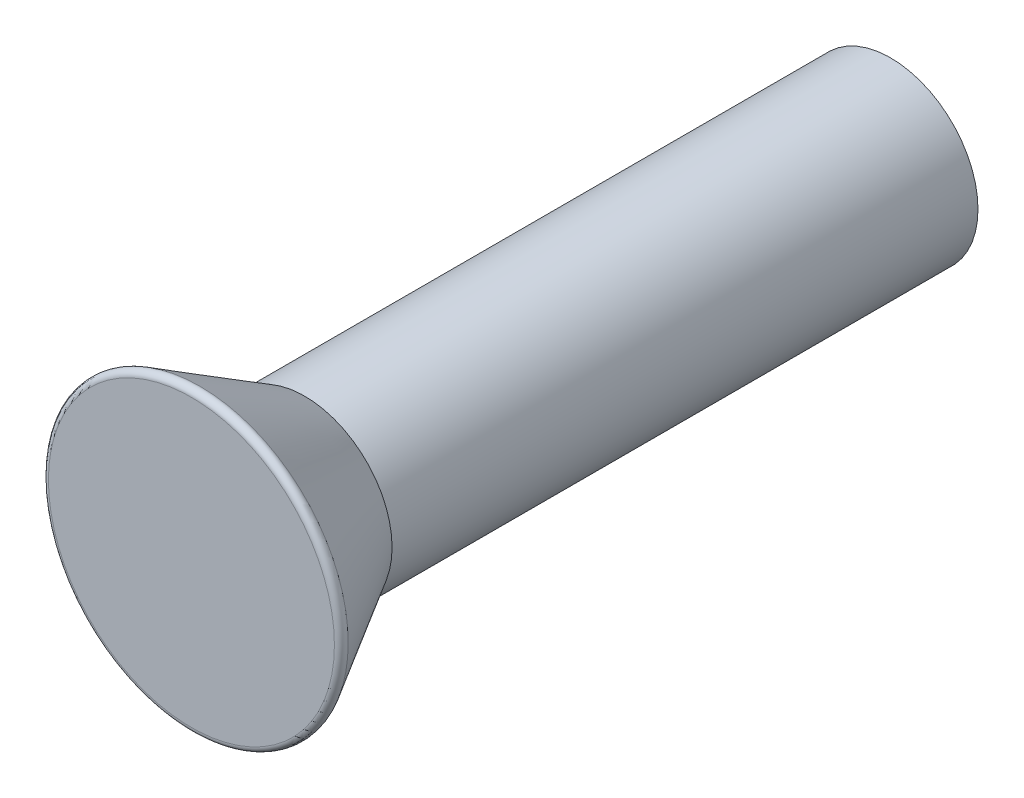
from build123d import *

# Parameters (mm, degrees)
FILLET_2_R = 0.211666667


with BuildPart() as part:
    # BaseBodySke → BaseBody (revolve)
    with BuildSketch(Plane(origin=(0, 0, 0), x_dir=(1, 0, 0), z_dir=(0, 1, 0)), mode=Mode.PRIVATE) as basebody_sk:
        Polygon((0, 0), (-5.5626, 0), (-3.175, 4.1148), (-3.175, 25.4), (0, 25.4), align=None)
    revolve(basebody_sk.sketch.rotate(Axis((0, 0, 0), (0, 0, -1)), 180), axis=Axis((0, 0, 0), (0, 0, -1)))

    # Fillet 2
    fillet_2_edges = [part.edges().sort_by_distance(p)[0] for p in [
        (-5.5626, 0, 0),
    ]]
    fillet(fillet_2_edges, radius=FILLET_2_R)


solid = part.part
